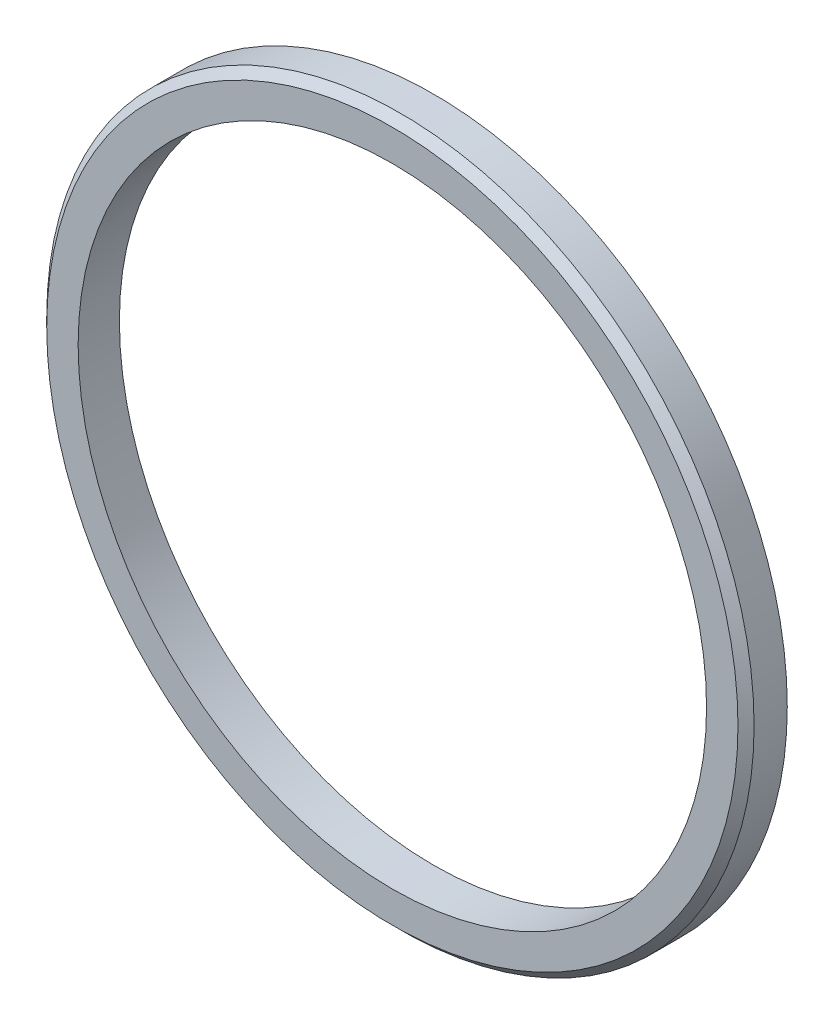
ISO-10303-21;
HEADER;
FILE_DESCRIPTION(('STEP AP214'),'2;1');
FILE_NAME('part.step','',(''),(''),'','','');
FILE_SCHEMA(('AUTOMOTIVE_DESIGN { 1 0 10303 214 1 1 1 1 }'));
ENDSEC;
DATA;
#1=APPLICATION_CONTEXT('core data for automotive mechanical design processes');
#2=APPLICATION_PROTOCOL_DEFINITION('international standard','automotive_design',2000,#1);
#3=PRODUCT_CONTEXT('',#1,'mechanical');
#4=PRODUCT('Part','Part','',(#3));
#5=PRODUCT_RELATED_PRODUCT_CATEGORY('part','',(#4));
#6=PRODUCT_DEFINITION_FORMATION('','',#4);
#7=PRODUCT_DEFINITION_CONTEXT('part definition',#1,'design');
#8=PRODUCT_DEFINITION('design','',#6,#7);
#9=PRODUCT_DEFINITION_SHAPE('','',#8);
#10=(LENGTH_UNIT() NAMED_UNIT(*) SI_UNIT(.MILLI.,.METRE.));
#11=(NAMED_UNIT(*) PLANE_ANGLE_UNIT() SI_UNIT($,.RADIAN.));
#12=(NAMED_UNIT(*) SI_UNIT($,.STERADIAN.) SOLID_ANGLE_UNIT());
#13=UNCERTAINTY_MEASURE_WITH_UNIT(LENGTH_MEASURE(1.E-05),#10,'distance_accuracy_value','');
#14=(GEOMETRIC_REPRESENTATION_CONTEXT(3) GLOBAL_UNCERTAINTY_ASSIGNED_CONTEXT((#13)) GLOBAL_UNIT_ASSIGNED_CONTEXT((#10,
#11,#12)) REPRESENTATION_CONTEXT('',''));
#15=CARTESIAN_POINT('',(0.,0.,0.));
#16=DIRECTION('',(0.,0.,1.));
#17=DIRECTION('',(1.,0.,0.));
#18=AXIS2_PLACEMENT_3D('',#15,#16,#17);
#19=CARTESIAN_POINT('',(0.,0.,1.28));
#20=DIRECTION('',(0.,0.,1.));
#21=DIRECTION('',(1.,0.,0.));
#22=AXIS2_PLACEMENT_3D('',#19,#20,#21);
#23=PLANE('',#22);
#24=CARTESIAN_POINT('',(0.,0.,1.28));
#25=DIRECTION('',(0.,0.,1.));
#26=DIRECTION('',(1.,0.,0.));
#27=AXIS2_PLACEMENT_3D('',#24,#25,#26);
#28=CIRCLE('',#27,10.725);
#29=CARTESIAN_POINT('',(10.725,0.,1.28));
#30=VERTEX_POINT('',#29);
#31=EDGE_CURVE('E48',#30,#30,#28,.T.);
#32=ORIENTED_EDGE('',*,*,#31,.T.);
#33=EDGE_LOOP('',(#32));
#34=FACE_BOUND('',#33,.T.);
#35=CARTESIAN_POINT('',(0.,0.,1.28));
#36=DIRECTION('',(0.,0.,1.));
#37=DIRECTION('',(1.,0.,0.));
#38=AXIS2_PLACEMENT_3D('',#35,#36,#37);
#39=CIRCLE('',#38,9.75);
#40=CARTESIAN_POINT('',(-9.75,0.,1.28));
#41=VERTEX_POINT('',#40);
#42=EDGE_CURVE('E58',#41,#41,#39,.T.);
#43=ORIENTED_EDGE('',*,*,#42,.F.);
#44=EDGE_LOOP('',(#43));
#45=FACE_BOUND('',#44,.T.);
#46=ADVANCED_FACE('F39',(#34,#45),#23,.T.);
#47=CARTESIAN_POINT('',(0.,0.,0.));
#48=DIRECTION('',(0.,0.,1.));
#49=DIRECTION('',(1.,0.,0.));
#50=AXIS2_PLACEMENT_3D('',#47,#48,#49);
#51=PLANE('',#50);
#52=CARTESIAN_POINT('',(0.,0.,0.));
#53=DIRECTION('',(0.,0.,1.));
#54=DIRECTION('',(1.,0.,0.));
#55=AXIS2_PLACEMENT_3D('',#52,#53,#54);
#56=CIRCLE('',#55,10.975);
#57=CARTESIAN_POINT('',(-10.975,0.,0.));
#58=VERTEX_POINT('',#57);
#59=EDGE_CURVE('E53',#58,#58,#56,.T.);
#60=ORIENTED_EDGE('',*,*,#59,.F.);
#61=EDGE_LOOP('',(#60));
#62=FACE_BOUND('',#61,.T.);
#63=CARTESIAN_POINT('',(0.,0.,0.));
#64=DIRECTION('',(0.,0.,1.));
#65=DIRECTION('',(1.,0.,0.));
#66=AXIS2_PLACEMENT_3D('',#63,#64,#65);
#67=CIRCLE('',#66,9.75);
#68=CARTESIAN_POINT('',(-9.75,0.,0.));
#69=VERTEX_POINT('',#68);
#70=EDGE_CURVE('E61',#69,#69,#67,.T.);
#71=ORIENTED_EDGE('',*,*,#70,.T.);
#72=EDGE_LOOP('',(#71));
#73=FACE_BOUND('',#72,.T.);
#74=ADVANCED_FACE('F73',(#62,#73),#51,.F.);
#75=CARTESIAN_POINT('',(0.,0.,1.28));
#76=DIRECTION('',(0.,0.,-1.));
#77=DIRECTION('',(-1.,0.,0.));
#78=AXIS2_PLACEMENT_3D('',#75,#76,#77);
#79=CYLINDRICAL_SURFACE('',#78,10.975);
#80=CARTESIAN_POINT('',(0.,0.,1.03000000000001));
#81=DIRECTION('',(0.,0.,1.));
#82=DIRECTION('',(1.,0.,0.));
#83=AXIS2_PLACEMENT_3D('',#80,#81,#82);
#84=CIRCLE('',#83,10.975);
#85=CARTESIAN_POINT('',(-10.975,0.,1.03000000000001));
#86=VERTEX_POINT('',#85);
#87=EDGE_CURVE('E10',#86,#86,#84,.F.);
#88=CARTESIAN_POINT('',(-10.975,0.,1.03000000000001));
#89=CARTESIAN_POINT('',(-10.975,0.,1.01927083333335));
#90=CARTESIAN_POINT('',(-10.975,0.,1.00854166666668));
#91=CARTESIAN_POINT('',(-10.975,0.,0.987083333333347));
#92=CARTESIAN_POINT('',(-10.975,0.,0.97635416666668));
#93=CARTESIAN_POINT('',(-10.975,0.,0.954895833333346));
#94=CARTESIAN_POINT('',(-10.975,0.,0.944166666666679));
#95=CARTESIAN_POINT('',(-10.975,0.,0.922708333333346));
#96=CARTESIAN_POINT('',(-10.975,0.,0.911979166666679));
#97=CARTESIAN_POINT('',(-10.975,0.,0.890520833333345));
#98=CARTESIAN_POINT('',(-10.975,0.,0.879791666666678));
#99=CARTESIAN_POINT('',(-10.975,0.,0.858333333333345));
#100=CARTESIAN_POINT('',(-10.975,0.,0.847604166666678));
#101=CARTESIAN_POINT('',(-10.975,0.,0.826145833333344));
#102=CARTESIAN_POINT('',(-10.975,0.,0.815416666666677));
#103=CARTESIAN_POINT('',(-10.975,0.,0.793958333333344));
#104=CARTESIAN_POINT('',(-10.975,0.,0.783229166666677));
#105=CARTESIAN_POINT('',(-10.975,0.,0.761770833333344));
#106=CARTESIAN_POINT('',(-10.975,0.,0.751041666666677));
#107=CARTESIAN_POINT('',(-10.975,0.,0.729583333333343));
#108=CARTESIAN_POINT('',(-10.975,0.,0.718854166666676));
#109=CARTESIAN_POINT('',(-10.975,0.,0.697395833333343));
#110=CARTESIAN_POINT('',(-10.975,0.,0.686666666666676));
#111=CARTESIAN_POINT('',(-10.975,0.,0.665208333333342));
#112=CARTESIAN_POINT('',(-10.975,0.,0.654479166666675));
#113=CARTESIAN_POINT('',(-10.975,0.,0.633020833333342));
#114=CARTESIAN_POINT('',(-10.975,0.,0.622291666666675));
#115=CARTESIAN_POINT('',(-10.975,0.,0.600833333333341));
#116=CARTESIAN_POINT('',(-10.975,0.,0.590104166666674));
#117=CARTESIAN_POINT('',(-10.975,0.,0.568645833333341));
#118=CARTESIAN_POINT('',(-10.975,0.,0.557916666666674));
#119=CARTESIAN_POINT('',(-10.975,0.,0.53645833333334));
#120=CARTESIAN_POINT('',(-10.975,0.,0.525729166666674));
#121=CARTESIAN_POINT('',(-10.975,0.,0.50427083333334));
#122=CARTESIAN_POINT('',(-10.975,0.,0.493541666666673));
#123=CARTESIAN_POINT('',(-10.975,0.,0.47208333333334));
#124=CARTESIAN_POINT('',(-10.975,0.,0.461354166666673));
#125=CARTESIAN_POINT('',(-10.975,0.,0.439895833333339));
#126=CARTESIAN_POINT('',(-10.975,0.,0.429166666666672));
#127=CARTESIAN_POINT('',(-10.975,0.,0.407708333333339));
#128=CARTESIAN_POINT('',(-10.975,0.,0.396979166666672));
#129=CARTESIAN_POINT('',(-10.975,0.,0.375520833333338));
#130=CARTESIAN_POINT('',(-10.975,0.,0.364791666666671));
#131=CARTESIAN_POINT('',(-10.975,0.,0.343333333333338));
#132=CARTESIAN_POINT('',(-10.975,0.,0.332604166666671));
#133=CARTESIAN_POINT('',(-10.975,0.,0.311145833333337));
#134=CARTESIAN_POINT('',(-10.975,0.,0.300416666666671));
#135=CARTESIAN_POINT('',(-10.975,0.,0.278958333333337));
#136=CARTESIAN_POINT('',(-10.975,0.,0.26822916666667));
#137=CARTESIAN_POINT('',(-10.975,0.,0.246770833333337));
#138=CARTESIAN_POINT('',(-10.975,0.,0.23604166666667));
#139=CARTESIAN_POINT('',(-10.975,0.,0.214583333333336));
#140=CARTESIAN_POINT('',(-10.975,0.,0.203854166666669));
#141=CARTESIAN_POINT('',(-10.975,0.,0.182395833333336));
#142=CARTESIAN_POINT('',(-10.975,0.,0.171666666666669));
#143=CARTESIAN_POINT('',(-10.975,0.,0.150208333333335));
#144=CARTESIAN_POINT('',(-10.975,0.,0.139479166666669));
#145=CARTESIAN_POINT('',(-10.975,0.,0.118020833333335));
#146=CARTESIAN_POINT('',(-10.975,0.,0.107291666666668));
#147=CARTESIAN_POINT('',(-10.975,0.,0.0858333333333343));
#148=CARTESIAN_POINT('',(-10.975,0.,0.0751041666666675));
#149=CARTESIAN_POINT('',(-10.975,0.,0.0536458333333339));
#150=CARTESIAN_POINT('',(-10.975,0.,0.0429166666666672));
#151=CARTESIAN_POINT('',(-10.975,0.,0.0214583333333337));
#152=CARTESIAN_POINT('',(-10.975,0.,0.0107291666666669));
#153=CARTESIAN_POINT('',(-10.975,0.,0.));
#154=B_SPLINE_CURVE_WITH_KNOTS('',3,(#88,#89,#90,#91,#92,#93,#94,#95,#96,#97,#98,#99,#100,#101,
#102,#103,#104,#105,#106,#107,#108,#109,#110,#111,#112,#113,#114,#115,#116,#117,#118,#119,#120,
#121,#122,#123,#124,#125,#126,#127,#128,#129,#130,#131,#132,#133,#134,#135,#136,#137,#138,#139,
#140,#141,#142,#143,#144,#145,#146,#147,#148,#149,#150,#151,#152,#153),.UNSPECIFIED.,.F.,.F.,(4,
2,2,2,2,2,2,2,2,2,2,2,2,2,2,2,2,2,2,2,2,2,2,2,2,2,2,2,2,2,2,2,4),(0.,0.0321875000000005,
0.0643750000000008,0.0965625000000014,0.128750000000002,0.160937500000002,0.193125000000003,
0.225312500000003,0.257500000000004,0.289687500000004,0.321875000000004,0.354062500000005,
0.386250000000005,0.418437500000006,0.450625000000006,0.482812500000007,0.515000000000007,
0.547187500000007,0.579375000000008,0.611562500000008,0.643750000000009,0.675937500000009,
0.70812500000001,0.74031250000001,0.77250000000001,0.804687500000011,0.836875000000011,
0.869062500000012,0.901250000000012,0.933437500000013,0.965625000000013,0.997812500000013,
1.03000000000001),.UNSPECIFIED.);
#155=EDGE_CURVE('BSEAM78',#86,#58,#154,.T.);
#156=ORIENTED_EDGE('',*,*,#87,.T.);
#157=ORIENTED_EDGE('',*,*,#59,.T.);
#158=ORIENTED_EDGE('',*,*,#155,.T.);
#159=ORIENTED_EDGE('',*,*,#155,.F.);
#160=EDGE_LOOP('',(#156,#158,#157,#159));
#161=FACE_BOUND('',#160,.T.);
#162=ADVANCED_FACE('F78',(#161),#79,.T.);
#163=CARTESIAN_POINT('',(0.,0.,1.28));
#164=DIRECTION('',(0.,0.,-1.));
#165=DIRECTION('',(-1.,0.,0.));
#166=AXIS2_PLACEMENT_3D('',#163,#164,#165);
#167=CYLINDRICAL_SURFACE('',#166,9.75);
#168=CARTESIAN_POINT('',(-9.75,0.,1.28));
#169=CARTESIAN_POINT('',(-9.75,0.,1.26666666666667));
#170=CARTESIAN_POINT('',(-9.75,0.,1.25333333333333));
#171=CARTESIAN_POINT('',(-9.75,0.,1.22666666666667));
#172=CARTESIAN_POINT('',(-9.75,0.,1.21333333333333));
#173=CARTESIAN_POINT('',(-9.75,0.,1.18666666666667));
#174=CARTESIAN_POINT('',(-9.75,0.,1.17333333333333));
#175=CARTESIAN_POINT('',(-9.75,0.,1.14666666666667));
#176=CARTESIAN_POINT('',(-9.75,0.,1.13333333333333));
#177=CARTESIAN_POINT('',(-9.75,0.,1.10666666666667));
#178=CARTESIAN_POINT('',(-9.75,0.,1.09333333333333));
#179=CARTESIAN_POINT('',(-9.75,0.,1.06666666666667));
#180=CARTESIAN_POINT('',(-9.75,0.,1.05333333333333));
#181=CARTESIAN_POINT('',(-9.75,0.,1.02666666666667));
#182=CARTESIAN_POINT('',(-9.75,0.,1.01333333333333));
#183=CARTESIAN_POINT('',(-9.75,0.,0.986666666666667));
#184=CARTESIAN_POINT('',(-9.75,0.,0.973333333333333));
#185=CARTESIAN_POINT('',(-9.75,0.,0.946666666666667));
#186=CARTESIAN_POINT('',(-9.75,0.,0.933333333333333));
#187=CARTESIAN_POINT('',(-9.75,0.,0.906666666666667));
#188=CARTESIAN_POINT('',(-9.75,0.,0.893333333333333));
#189=CARTESIAN_POINT('',(-9.75,0.,0.866666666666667));
#190=CARTESIAN_POINT('',(-9.75,0.,0.853333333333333));
#191=CARTESIAN_POINT('',(-9.75,0.,0.826666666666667));
#192=CARTESIAN_POINT('',(-9.75,0.,0.813333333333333));
#193=CARTESIAN_POINT('',(-9.75,0.,0.786666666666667));
#194=CARTESIAN_POINT('',(-9.75,0.,0.773333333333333));
#195=CARTESIAN_POINT('',(-9.75,0.,0.746666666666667));
#196=CARTESIAN_POINT('',(-9.75,0.,0.733333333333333));
#197=CARTESIAN_POINT('',(-9.75,0.,0.706666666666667));
#198=CARTESIAN_POINT('',(-9.75,0.,0.693333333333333));
#199=CARTESIAN_POINT('',(-9.75,0.,0.666666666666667));
#200=CARTESIAN_POINT('',(-9.75,0.,0.653333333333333));
#201=CARTESIAN_POINT('',(-9.75,0.,0.626666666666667));
#202=CARTESIAN_POINT('',(-9.75,0.,0.613333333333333));
#203=CARTESIAN_POINT('',(-9.75,0.,0.586666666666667));
#204=CARTESIAN_POINT('',(-9.75,0.,0.573333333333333));
#205=CARTESIAN_POINT('',(-9.75,0.,0.546666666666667));
#206=CARTESIAN_POINT('',(-9.75,0.,0.533333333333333));
#207=CARTESIAN_POINT('',(-9.75,0.,0.506666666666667));
#208=CARTESIAN_POINT('',(-9.75,0.,0.493333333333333));
#209=CARTESIAN_POINT('',(-9.75,0.,0.466666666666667));
#210=CARTESIAN_POINT('',(-9.75,0.,0.453333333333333));
#211=CARTESIAN_POINT('',(-9.75,0.,0.426666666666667));
#212=CARTESIAN_POINT('',(-9.75,0.,0.413333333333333));
#213=CARTESIAN_POINT('',(-9.75,0.,0.386666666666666));
#214=CARTESIAN_POINT('',(-9.75,0.,0.373333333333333));
#215=CARTESIAN_POINT('',(-9.75,0.,0.346666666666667));
#216=CARTESIAN_POINT('',(-9.75,0.,0.333333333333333));
#217=CARTESIAN_POINT('',(-9.75,0.,0.306666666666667));
#218=CARTESIAN_POINT('',(-9.75,0.,0.293333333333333));
#219=CARTESIAN_POINT('',(-9.75,0.,0.266666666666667));
#220=CARTESIAN_POINT('',(-9.75,0.,0.253333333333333));
#221=CARTESIAN_POINT('',(-9.75,0.,0.226666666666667));
#222=CARTESIAN_POINT('',(-9.75,0.,0.213333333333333));
#223=CARTESIAN_POINT('',(-9.75,0.,0.186666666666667));
#224=CARTESIAN_POINT('',(-9.75,0.,0.173333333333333));
#225=CARTESIAN_POINT('',(-9.75,0.,0.146666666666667));
#226=CARTESIAN_POINT('',(-9.75,0.,0.133333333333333));
#227=CARTESIAN_POINT('',(-9.75,0.,0.106666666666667));
#228=CARTESIAN_POINT('',(-9.75,0.,0.0933333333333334));
#229=CARTESIAN_POINT('',(-9.75,0.,0.0666666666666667));
#230=CARTESIAN_POINT('',(-9.75,0.,0.0533333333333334));
#231=CARTESIAN_POINT('',(-9.75,0.,0.0266666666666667));
#232=CARTESIAN_POINT('',(-9.75,0.,0.0133333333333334));
#233=CARTESIAN_POINT('',(-9.75,0.,0.));
#234=B_SPLINE_CURVE_WITH_KNOTS('',3,(#168,#169,#170,#171,#172,#173,#174,#175,#176,#177,#178,
#179,#180,#181,#182,#183,#184,#185,#186,#187,#188,#189,#190,#191,#192,#193,#194,#195,#196,#197,
#198,#199,#200,#201,#202,#203,#204,#205,#206,#207,#208,#209,#210,#211,#212,#213,#214,#215,#216,
#217,#218,#219,#220,#221,#222,#223,#224,#225,#226,#227,#228,#229,#230,#231,#232,#233),
.UNSPECIFIED.,.F.,.F.,(4,2,2,2,2,2,2,2,2,2,2,2,2,2,2,2,2,2,2,2,2,2,2,2,2,2,2,2,2,2,2,2,4),(0.,
0.0400000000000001,0.0800000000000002,0.12,0.16,0.2,0.24,0.28,0.32,0.36,0.4,0.44,0.48,0.52,0.56,
0.6,0.64,0.68,0.72,0.76,0.8,0.84,0.88,0.92,0.96,1.,1.04,1.08,1.12,1.16,1.2,1.24,1.28),.UNSPECIFIED.);
#235=EDGE_CURVE('BSEAM69',#41,#69,#234,.T.);
#236=ORIENTED_EDGE('',*,*,#42,.T.);
#237=ORIENTED_EDGE('',*,*,#70,.F.);
#238=ORIENTED_EDGE('',*,*,#235,.T.);
#239=ORIENTED_EDGE('',*,*,#235,.F.);
#240=EDGE_LOOP('',(#236,#238,#237,#239));
#241=FACE_BOUND('',#240,.T.);
#242=ADVANCED_FACE('F69',(#241),#167,.F.);
#243=CARTESIAN_POINT('',(0.,0.,1.28));
#244=DIRECTION('',(0.,0.,-1.));
#245=DIRECTION('',(-1.,0.,0.));
#246=AXIS2_PLACEMENT_3D('',#243,#244,#245);
#247=CONICAL_SURFACE('',#246,10.725,0.785398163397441);
#248=ORIENTED_EDGE('',*,*,#87,.F.);
#249=EDGE_LOOP('',(#248));
#250=FACE_BOUND('',#249,.T.);
#251=ORIENTED_EDGE('',*,*,#31,.F.);
#252=EDGE_LOOP('',(#251));
#253=FACE_BOUND('',#252,.T.);
#254=ADVANCED_FACE('F42',(#250,#253),#247,.T.);
#255=CLOSED_SHELL('',(#46,#74,#162,#242,#254));
#256=MANIFOLD_SOLID_BREP('B2',#255);
#257=ADVANCED_BREP_SHAPE_REPRESENTATION('',(#18,#256),#14);
#258=SHAPE_DEFINITION_REPRESENTATION(#9,#257);
ENDSEC;
END-ISO-10303-21;
